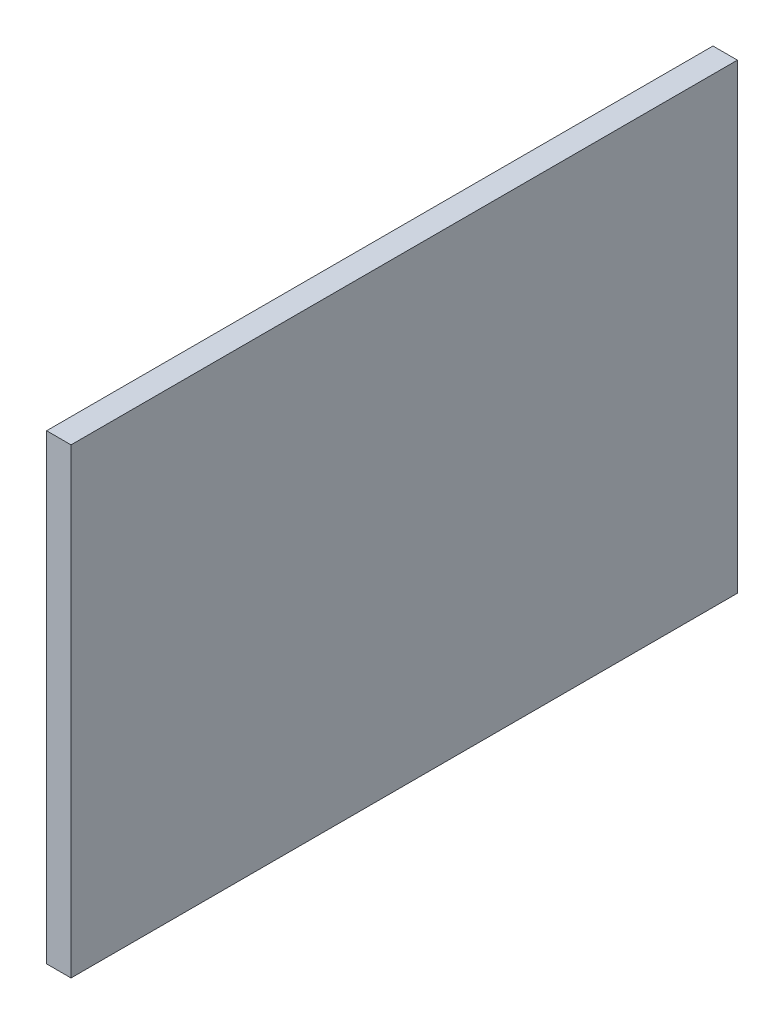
from build123d import *

# Parameters (mm, degrees)
ESBO_O2_W                = 17.978931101
ESBO_O2_H                = 339.5
RESSALTO_EXTRUS_O1_DEPTH = 490


with BuildPart() as part:
    # Esbo_o2 → Ressalto-extrus_o1 (new body)
    with BuildSketch(Plane.XY):
        with Locations((271.98946555, 817.25)):
            Rectangle(ESBO_O2_W, ESBO_O2_H)
    extrude(amount=-RESSALTO_EXTRUS_O1_DEPTH)


solid = part.part
